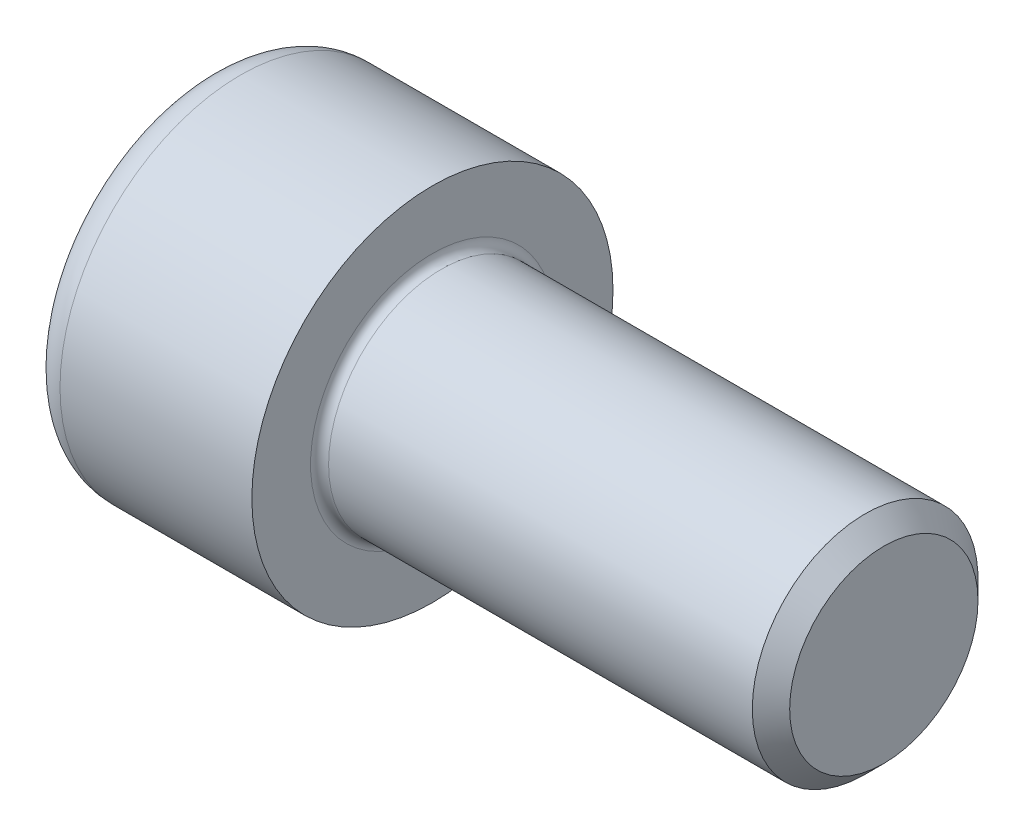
ISO-10303-21;
HEADER;
FILE_DESCRIPTION(('STEP AP214'),'2;1');
FILE_NAME('part.step','',(''),(''),'','','');
FILE_SCHEMA(('AUTOMOTIVE_DESIGN { 1 0 10303 214 1 1 1 1 }'));
ENDSEC;
DATA;
#1=APPLICATION_CONTEXT('core data for automotive mechanical design processes');
#2=APPLICATION_PROTOCOL_DEFINITION('international standard','automotive_design',2000,#1);
#3=PRODUCT_CONTEXT('',#1,'mechanical');
#4=PRODUCT('Part','Part','',(#3));
#5=PRODUCT_RELATED_PRODUCT_CATEGORY('part','',(#4));
#6=PRODUCT_DEFINITION_FORMATION('','',#4);
#7=PRODUCT_DEFINITION_CONTEXT('part definition',#1,'design');
#8=PRODUCT_DEFINITION('design','',#6,#7);
#9=PRODUCT_DEFINITION_SHAPE('','',#8);
#10=(LENGTH_UNIT() NAMED_UNIT(*) SI_UNIT(.MILLI.,.METRE.));
#11=(NAMED_UNIT(*) PLANE_ANGLE_UNIT() SI_UNIT($,.RADIAN.));
#12=(NAMED_UNIT(*) SI_UNIT($,.STERADIAN.) SOLID_ANGLE_UNIT());
#13=UNCERTAINTY_MEASURE_WITH_UNIT(LENGTH_MEASURE(1.E-05),#10,'distance_accuracy_value','');
#14=(GEOMETRIC_REPRESENTATION_CONTEXT(3) GLOBAL_UNCERTAINTY_ASSIGNED_CONTEXT((#13)) GLOBAL_UNIT_ASSIGNED_CONTEXT((#10,
#11,#12)) REPRESENTATION_CONTEXT('',''));
#15=CARTESIAN_POINT('',(0.,0.,0.));
#16=DIRECTION('',(0.,0.,1.));
#17=DIRECTION('',(1.,0.,0.));
#18=AXIS2_PLACEMENT_3D('',#15,#16,#17);
#19=CARTESIAN_POINT('',(0.,0.,0.));
#20=DIRECTION('',(-1.,0.,0.));
#21=DIRECTION('',(0.,0.,1.));
#22=AXIS2_PLACEMENT_3D('',#19,#20,#21);
#23=PLANE('',#22);
#24=DIRECTION('',(0.,-0.499999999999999,0.866025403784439));
#25=VECTOR('',#24,1.);
#26=CARTESIAN_POINT('',(0.,4.68519743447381,0.));
#27=LINE('',#26,#25);
#28=CARTESIAN_POINT('',(0.,4.68519743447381,0.));
#29=VERTEX_POINT('',#28);
#30=CARTESIAN_POINT('',(0.,2.34259871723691,4.05749999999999));
#31=VERTEX_POINT('',#30);
#32=EDGE_CURVE('E257',#29,#31,#27,.T.);
#33=ORIENTED_EDGE('',*,*,#32,.T.);
#34=DIRECTION('',(0.,1.,0.));
#35=VECTOR('',#34,1.);
#36=CARTESIAN_POINT('',(0.,-2.3425987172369,4.0575));
#37=LINE('',#36,#35);
#38=CARTESIAN_POINT('',(0.,-2.3425987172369,4.0575));
#39=VERTEX_POINT('',#38);
#40=EDGE_CURVE('E129',#39,#31,#37,.T.);
#41=ORIENTED_EDGE('',*,*,#40,.F.);
#42=DIRECTION('',(0.,-0.500000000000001,-0.866025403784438));
#43=VECTOR('',#42,1.);
#44=CARTESIAN_POINT('',(0.,-2.3425987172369,4.0575));
#45=LINE('',#44,#43);
#46=CARTESIAN_POINT('',(0.,-4.68519743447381,0.));
#47=VERTEX_POINT('',#46);
#48=EDGE_CURVE('E260',#39,#47,#45,.T.);
#49=ORIENTED_EDGE('',*,*,#48,.T.);
#50=DIRECTION('',(0.,0.499999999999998,-0.86602540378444));
#51=VECTOR('',#50,1.);
#52=CARTESIAN_POINT('',(0.,-4.68519743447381,0.));
#53=LINE('',#52,#51);
#54=CARTESIAN_POINT('',(0.,-2.34259871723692,-4.0575));
#55=VERTEX_POINT('',#54);
#56=EDGE_CURVE('E263',#47,#55,#53,.T.);
#57=ORIENTED_EDGE('',*,*,#56,.T.);
#58=DIRECTION('',(0.,-1.,0.));
#59=VECTOR('',#58,1.);
#60=CARTESIAN_POINT('',(0.,2.3425987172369,-4.0575));
#61=LINE('',#60,#59);
#62=CARTESIAN_POINT('',(0.,2.3425987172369,-4.0575));
#63=VERTEX_POINT('',#62);
#64=EDGE_CURVE('E266',#63,#55,#61,.T.);
#65=ORIENTED_EDGE('',*,*,#64,.F.);
#66=DIRECTION('',(0.,-0.500000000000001,-0.866025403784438));
#67=VECTOR('',#66,1.);
#68=CARTESIAN_POINT('',(0.,4.68519743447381,0.));
#69=LINE('',#68,#67);
#70=EDGE_CURVE('E124',#29,#63,#69,.T.);
#71=ORIENTED_EDGE('',*,*,#70,.F.);
#72=EDGE_LOOP('',(#33,#41,#49,#57,#65,#71));
#73=FACE_BOUND('',#72,.T.);
#74=CARTESIAN_POINT('',(0.,0.,0.));
#75=DIRECTION('',(-1.,0.,0.));
#76=DIRECTION('',(0.,0.,1.));
#77=AXIS2_PLACEMENT_3D('',#74,#75,#76);
#78=CIRCLE('',#77,6.5);
#79=CARTESIAN_POINT('',(0.,0.,6.5));
#80=VERTEX_POINT('',#79);
#81=EDGE_CURVE('E41',#80,#80,#78,.T.);
#82=ORIENTED_EDGE('',*,*,#81,.T.);
#83=EDGE_LOOP('',(#82));
#84=FACE_BOUND('',#83,.T.);
#85=ADVANCED_FACE('F33',(#73,#84),#23,.T.);
#86=CARTESIAN_POINT('',(-31.75,0.,0.));
#87=DIRECTION('',(-1.,0.,0.));
#88=DIRECTION('',(0.,0.,1.));
#89=AXIS2_PLACEMENT_3D('',#86,#87,#88);
#90=CYLINDRICAL_SURFACE('',#89,8.);
#91=CARTESIAN_POINT('',(1.5,0.,0.));
#92=DIRECTION('',(-1.,0.,0.));
#93=DIRECTION('',(0.,0.,1.));
#94=AXIS2_PLACEMENT_3D('',#91,#92,#93);
#95=CIRCLE('',#94,8.);
#96=CARTESIAN_POINT('',(1.5,0.,8.));
#97=VERTEX_POINT('',#96);
#98=EDGE_CURVE('E11',#97,#97,#95,.F.);
#99=ORIENTED_EDGE('',*,*,#98,.T.);
#100=EDGE_LOOP('',(#99));
#101=FACE_BOUND('',#100,.T.);
#102=CARTESIAN_POINT('',(10.,0.,0.));
#103=DIRECTION('',(-1.,0.,0.));
#104=DIRECTION('',(0.,0.,1.));
#105=AXIS2_PLACEMENT_3D('',#102,#103,#104);
#106=CIRCLE('',#105,8.);
#107=CARTESIAN_POINT('',(10.,0.,8.));
#108=VERTEX_POINT('',#107);
#109=EDGE_CURVE('E147',#108,#108,#106,.T.);
#110=ORIENTED_EDGE('',*,*,#109,.T.);
#111=EDGE_LOOP('',(#110));
#112=FACE_BOUND('',#111,.T.);
#113=ADVANCED_FACE('F171',(#101,#112),#90,.T.);
#114=CARTESIAN_POINT('',(10.,8.,0.));
#115=DIRECTION('',(1.,0.,0.));
#116=DIRECTION('',(0.,0.,-1.));
#117=AXIS2_PLACEMENT_3D('',#114,#115,#116);
#118=PLANE('',#117);
#119=CARTESIAN_POINT('',(10.,0.,0.));
#120=DIRECTION('',(1.,0.,0.));
#121=DIRECTION('',(0.,0.,-1.));
#122=AXIS2_PLACEMENT_3D('',#119,#120,#121);
#123=CIRCLE('',#122,5.4);
#124=CARTESIAN_POINT('',(10.,0.,-5.4));
#125=VERTEX_POINT('',#124);
#126=EDGE_CURVE('E150',#125,#125,#123,.F.);
#127=ORIENTED_EDGE('',*,*,#126,.T.);
#128=EDGE_LOOP('',(#127));
#129=FACE_BOUND('',#128,.T.);
#130=ORIENTED_EDGE('',*,*,#109,.F.);
#131=EDGE_LOOP('',(#130));
#132=FACE_BOUND('',#131,.T.);
#133=ADVANCED_FACE('F177',(#129,#132),#118,.T.);
#134=CARTESIAN_POINT('',(-31.75,0.,0.));
#135=DIRECTION('',(-1.,0.,0.));
#136=DIRECTION('',(0.,0.,1.));
#137=AXIS2_PLACEMENT_3D('',#134,#135,#136);
#138=CYLINDRICAL_SURFACE('',#137,5.);
#139=CARTESIAN_POINT('',(10.4,0.,0.));
#140=DIRECTION('',(1.,0.,0.));
#141=DIRECTION('',(0.,0.,-1.));
#142=AXIS2_PLACEMENT_3D('',#139,#140,#141);
#143=CIRCLE('',#142,5.);
#144=CARTESIAN_POINT('',(10.4,0.,-5.));
#145=VERTEX_POINT('',#144);
#146=EDGE_CURVE('E153',#145,#145,#143,.T.);
#147=ORIENTED_EDGE('',*,*,#146,.T.);
#148=EDGE_LOOP('',(#147));
#149=FACE_BOUND('',#148,.T.);
#150=CARTESIAN_POINT('',(29.172,0.,0.));
#151=DIRECTION('',(-1.,0.,0.));
#152=DIRECTION('',(0.,0.,1.));
#153=AXIS2_PLACEMENT_3D('',#150,#151,#152);
#154=CIRCLE('',#153,5.);
#155=CARTESIAN_POINT('',(29.172,0.,5.));
#156=VERTEX_POINT('',#155);
#157=EDGE_CURVE('E144',#156,#156,#154,.T.);
#158=ORIENTED_EDGE('',*,*,#157,.T.);
#159=EDGE_LOOP('',(#158));
#160=FACE_BOUND('',#159,.T.);
#161=ADVANCED_FACE('F183',(#149,#160),#138,.T.);
#162=CARTESIAN_POINT('',(30.,0.,0.));
#163=DIRECTION('',(-1.,0.,0.));
#164=DIRECTION('',(0.,0.,1.));
#165=AXIS2_PLACEMENT_3D('',#162,#163,#164);
#166=CONICAL_SURFACE('',#165,4.172,0.785398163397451);
#167=ORIENTED_EDGE('',*,*,#157,.F.);
#168=EDGE_LOOP('',(#167));
#169=FACE_BOUND('',#168,.T.);
#170=CARTESIAN_POINT('',(30.,0.,0.));
#171=DIRECTION('',(-1.,0.,0.));
#172=DIRECTION('',(0.,0.,1.));
#173=AXIS2_PLACEMENT_3D('',#170,#171,#172);
#174=CIRCLE('',#173,4.172);
#175=CARTESIAN_POINT('',(30.,0.,4.172));
#176=VERTEX_POINT('',#175);
#177=EDGE_CURVE('E140',#176,#176,#174,.T.);
#178=ORIENTED_EDGE('',*,*,#177,.T.);
#179=EDGE_LOOP('',(#178));
#180=FACE_BOUND('',#179,.T.);
#181=ADVANCED_FACE('F187',(#169,#180),#166,.T.);
#182=CARTESIAN_POINT('',(30.,4.172,0.));
#183=DIRECTION('',(1.,0.,0.));
#184=DIRECTION('',(0.,0.,-1.));
#185=AXIS2_PLACEMENT_3D('',#182,#183,#184);
#186=PLANE('',#185);
#187=ORIENTED_EDGE('',*,*,#177,.F.);
#188=EDGE_LOOP('',(#187));
#189=FACE_BOUND('',#188,.T.);
#190=ADVANCED_FACE('F167',(#189),#186,.T.);
#191=CARTESIAN_POINT('',(10.4,0.,0.));
#192=DIRECTION('',(1.,0.,0.));
#193=DIRECTION('',(0.,0.,-1.));
#194=AXIS2_PLACEMENT_3D('',#191,#192,#193);
#195=TOROIDAL_SURFACE('',#194,5.4,0.4);
#196=ORIENTED_EDGE('',*,*,#146,.F.);
#197=EDGE_LOOP('',(#196));
#198=FACE_BOUND('',#197,.T.);
#199=ORIENTED_EDGE('',*,*,#126,.F.);
#200=EDGE_LOOP('',(#199));
#201=FACE_BOUND('',#200,.T.);
#202=ADVANCED_FACE('F160',(#198,#201),#195,.F.);
#203=CARTESIAN_POINT('',(1.5,0.,0.));
#204=DIRECTION('',(-1.,0.,0.));
#205=DIRECTION('',(0.,0.,1.));
#206=AXIS2_PLACEMENT_3D('',#203,#204,#205);
#207=TOROIDAL_SURFACE('',#206,6.5,1.5);
#208=ORIENTED_EDGE('',*,*,#98,.F.);
#209=EDGE_LOOP('',(#208));
#210=FACE_BOUND('',#209,.T.);
#211=ORIENTED_EDGE('',*,*,#81,.F.);
#212=EDGE_LOOP('',(#211));
#213=FACE_BOUND('',#212,.T.);
#214=ADVANCED_FACE('F35',(#210,#213),#207,.T.);
#215=CARTESIAN_POINT('',(5.,4.68519743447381,0.));
#216=DIRECTION('',(0.,-0.866025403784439,-0.499999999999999));
#217=DIRECTION('',(0.,0.499999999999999,-0.866025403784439));
#218=AXIS2_PLACEMENT_3D('',#215,#216,#217);
#219=PLANE('',#218);
#220=ORIENTED_EDGE('',*,*,#32,.F.);
#221=DIRECTION('',(-1.,0.,0.));
#222=VECTOR('',#221,1.);
#223=CARTESIAN_POINT('',(5.,4.68519743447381,0.));
#224=LINE('',#223,#222);
#225=CARTESIAN_POINT('',(5.,4.68519743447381,0.));
#226=VERTEX_POINT('',#225);
#227=EDGE_CURVE('E247',#226,#29,#224,.T.);
#228=ORIENTED_EDGE('',*,*,#227,.F.);
#229=DIRECTION('',(0.,-0.499999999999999,0.866025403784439));
#230=VECTOR('',#229,1.);
#231=CARTESIAN_POINT('',(5.,4.68519743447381,0.));
#232=LINE('',#231,#230);
#233=CARTESIAN_POINT('',(5.,3.51389807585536,2.02874999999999));
#234=VERTEX_POINT('',#233);
#235=EDGE_CURVE('E116',#226,#234,#232,.T.);
#236=ORIENTED_EDGE('',*,*,#235,.T.);
#237=CARTESIAN_POINT('',(5.,2.34259871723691,4.05749999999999));
#238=VERTEX_POINT('',#237);
#239=EDGE_CURVE('E107',#234,#238,#232,.T.);
#240=ORIENTED_EDGE('',*,*,#239,.T.);
#241=DIRECTION('',(-1.,0.,0.));
#242=VECTOR('',#241,1.);
#243=CARTESIAN_POINT('',(5.,2.34259871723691,4.05749999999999));
#244=LINE('',#243,#242);
#245=EDGE_CURVE('E121',#238,#31,#244,.T.);
#246=ORIENTED_EDGE('',*,*,#245,.T.);
#247=EDGE_LOOP('',(#220,#228,#236,#240,#246));
#248=FACE_BOUND('',#247,.T.);
#249=ADVANCED_FACE('F120',(#248),#219,.T.);
#250=CARTESIAN_POINT('',(5.,-2.3425987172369,4.0575));
#251=DIRECTION('',(0.,0.,1.));
#252=DIRECTION('',(0.,-1.,0.));
#253=AXIS2_PLACEMENT_3D('',#250,#251,#252);
#254=PLANE('',#253);
#255=ORIENTED_EDGE('',*,*,#40,.T.);
#256=ORIENTED_EDGE('',*,*,#245,.F.);
#257=DIRECTION('',(0.,1.,0.));
#258=VECTOR('',#257,1.);
#259=CARTESIAN_POINT('',(5.,-2.3425987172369,4.0575));
#260=LINE('',#259,#258);
#261=CARTESIAN_POINT('',(5.,0.,4.05749999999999));
#262=VERTEX_POINT('',#261);
#263=EDGE_CURVE('E104',#262,#238,#260,.T.);
#264=ORIENTED_EDGE('',*,*,#263,.F.);
#265=CARTESIAN_POINT('',(5.,-2.3425987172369,4.0575));
#266=VERTEX_POINT('',#265);
#267=EDGE_CURVE('E115',#266,#262,#260,.T.);
#268=ORIENTED_EDGE('',*,*,#267,.F.);
#269=DIRECTION('',(-1.,0.,0.));
#270=VECTOR('',#269,1.);
#271=CARTESIAN_POINT('',(5.,-2.3425987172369,4.0575));
#272=LINE('',#271,#270);
#273=EDGE_CURVE('E131',#266,#39,#272,.T.);
#274=ORIENTED_EDGE('',*,*,#273,.T.);
#275=EDGE_LOOP('',(#255,#256,#264,#268,#274));
#276=FACE_BOUND('',#275,.T.);
#277=ADVANCED_FACE('F126',(#276),#254,.F.);
#278=CARTESIAN_POINT('',(5.,-2.3425987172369,4.0575));
#279=DIRECTION('',(0.,0.866025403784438,-0.500000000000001));
#280=DIRECTION('',(0.,0.500000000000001,0.866025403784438));
#281=AXIS2_PLACEMENT_3D('',#278,#279,#280);
#282=PLANE('',#281);
#283=ORIENTED_EDGE('',*,*,#48,.F.);
#284=ORIENTED_EDGE('',*,*,#273,.F.);
#285=DIRECTION('',(0.,-0.500000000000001,-0.866025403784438));
#286=VECTOR('',#285,1.);
#287=CARTESIAN_POINT('',(5.,-2.3425987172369,4.0575));
#288=LINE('',#287,#286);
#289=CARTESIAN_POINT('',(5.,-3.51389807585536,2.02875));
#290=VERTEX_POINT('',#289);
#291=EDGE_CURVE('E286',#266,#290,#288,.T.);
#292=ORIENTED_EDGE('',*,*,#291,.T.);
#293=CARTESIAN_POINT('',(5.,-4.68519743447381,0.));
#294=VERTEX_POINT('',#293);
#295=EDGE_CURVE('E275',#290,#294,#288,.T.);
#296=ORIENTED_EDGE('',*,*,#295,.T.);
#297=DIRECTION('',(-1.,0.,0.));
#298=VECTOR('',#297,1.);
#299=CARTESIAN_POINT('',(5.,-4.68519743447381,0.));
#300=LINE('',#299,#298);
#301=EDGE_CURVE('E136',#294,#47,#300,.T.);
#302=ORIENTED_EDGE('',*,*,#301,.T.);
#303=EDGE_LOOP('',(#283,#284,#292,#296,#302));
#304=FACE_BOUND('',#303,.T.);
#305=ADVANCED_FACE('F201',(#304),#282,.T.);
#306=CARTESIAN_POINT('',(5.,-4.68519743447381,0.));
#307=DIRECTION('',(0.,0.86602540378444,0.499999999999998));
#308=DIRECTION('',(0.,-0.499999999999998,0.86602540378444));
#309=AXIS2_PLACEMENT_3D('',#306,#307,#308);
#310=PLANE('',#309);
#311=ORIENTED_EDGE('',*,*,#56,.F.);
#312=ORIENTED_EDGE('',*,*,#301,.F.);
#313=DIRECTION('',(0.,0.499999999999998,-0.86602540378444));
#314=VECTOR('',#313,1.);
#315=CARTESIAN_POINT('',(5.,-4.68519743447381,0.));
#316=LINE('',#315,#314);
#317=CARTESIAN_POINT('',(5.,-3.51389807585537,-2.02875));
#318=VERTEX_POINT('',#317);
#319=EDGE_CURVE('E253',#294,#318,#316,.T.);
#320=ORIENTED_EDGE('',*,*,#319,.T.);
#321=CARTESIAN_POINT('',(5.,-2.34259871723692,-4.0575));
#322=VERTEX_POINT('',#321);
#323=EDGE_CURVE('E285',#318,#322,#316,.T.);
#324=ORIENTED_EDGE('',*,*,#323,.T.);
#325=DIRECTION('',(-1.,0.,0.));
#326=VECTOR('',#325,1.);
#327=CARTESIAN_POINT('',(5.,-2.34259871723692,-4.0575));
#328=LINE('',#327,#326);
#329=EDGE_CURVE('E246',#322,#55,#328,.T.);
#330=ORIENTED_EDGE('',*,*,#329,.T.);
#331=EDGE_LOOP('',(#311,#312,#320,#324,#330));
#332=FACE_BOUND('',#331,.T.);
#333=ADVANCED_FACE('F204',(#332),#310,.T.);
#334=CARTESIAN_POINT('',(5.,2.3425987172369,-4.0575));
#335=DIRECTION('',(0.,0.,-1.));
#336=DIRECTION('',(0.,1.,0.));
#337=AXIS2_PLACEMENT_3D('',#334,#335,#336);
#338=PLANE('',#337);
#339=ORIENTED_EDGE('',*,*,#64,.T.);
#340=ORIENTED_EDGE('',*,*,#329,.F.);
#341=DIRECTION('',(0.,-1.,0.));
#342=VECTOR('',#341,1.);
#343=CARTESIAN_POINT('',(5.,2.3425987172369,-4.0575));
#344=LINE('',#343,#342);
#345=CARTESIAN_POINT('',(5.,0.,-4.0575));
#346=VERTEX_POINT('',#345);
#347=EDGE_CURVE('E250',#346,#322,#344,.T.);
#348=ORIENTED_EDGE('',*,*,#347,.F.);
#349=CARTESIAN_POINT('',(5.,2.3425987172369,-4.0575));
#350=VERTEX_POINT('',#349);
#351=EDGE_CURVE('E48',#350,#346,#344,.T.);
#352=ORIENTED_EDGE('',*,*,#351,.F.);
#353=DIRECTION('',(-1.,0.,0.));
#354=VECTOR('',#353,1.);
#355=CARTESIAN_POINT('',(5.,2.3425987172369,-4.0575));
#356=LINE('',#355,#354);
#357=EDGE_CURVE('E243',#350,#63,#356,.T.);
#358=ORIENTED_EDGE('',*,*,#357,.T.);
#359=EDGE_LOOP('',(#339,#340,#348,#352,#358));
#360=FACE_BOUND('',#359,.T.);
#361=ADVANCED_FACE('F208',(#360),#338,.F.);
#362=CARTESIAN_POINT('',(5.,4.68519743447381,0.));
#363=DIRECTION('',(0.,0.866025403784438,-0.500000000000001));
#364=DIRECTION('',(0.,0.500000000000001,0.866025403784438));
#365=AXIS2_PLACEMENT_3D('',#362,#363,#364);
#366=PLANE('',#365);
#367=ORIENTED_EDGE('',*,*,#70,.T.);
#368=ORIENTED_EDGE('',*,*,#357,.F.);
#369=DIRECTION('',(0.,-0.500000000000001,-0.866025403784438));
#370=VECTOR('',#369,1.);
#371=CARTESIAN_POINT('',(5.,4.68519743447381,0.));
#372=LINE('',#371,#370);
#373=CARTESIAN_POINT('',(5.,3.51389807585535,-2.02875));
#374=VERTEX_POINT('',#373);
#375=EDGE_CURVE('E233',#374,#350,#372,.T.);
#376=ORIENTED_EDGE('',*,*,#375,.F.);
#377=EDGE_CURVE('E239',#226,#374,#372,.T.);
#378=ORIENTED_EDGE('',*,*,#377,.F.);
#379=ORIENTED_EDGE('',*,*,#227,.T.);
#380=EDGE_LOOP('',(#367,#368,#376,#378,#379));
#381=FACE_BOUND('',#380,.T.);
#382=ADVANCED_FACE('F212',(#381),#366,.F.);
#383=CARTESIAN_POINT('',(5.,7.02779615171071,-4.05750000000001));
#384=DIRECTION('',(1.,0.,0.));
#385=DIRECTION('',(0.,0.,-1.));
#386=AXIS2_PLACEMENT_3D('',#383,#384,#385);
#387=PLANE('',#386);
#388=ORIENTED_EDGE('',*,*,#347,.T.);
#389=ORIENTED_EDGE('',*,*,#323,.F.);
#390=CARTESIAN_POINT('',(5.,0.,0.));
#391=DIRECTION('',(-1.,0.,0.));
#392=DIRECTION('',(0.,0.,1.));
#393=AXIS2_PLACEMENT_3D('',#390,#391,#392);
#394=CIRCLE('',#393,4.0575);
#395=EDGE_CURVE('E281',#346,#318,#394,.T.);
#396=ORIENTED_EDGE('',*,*,#395,.F.);
#397=EDGE_LOOP('',(#388,#389,#396));
#398=FACE_BOUND('',#397,.T.);
#399=ADVANCED_FACE('F216',(#398),#387,.F.);
#400=ORIENTED_EDGE('',*,*,#319,.F.);
#401=ORIENTED_EDGE('',*,*,#295,.F.);
#402=EDGE_CURVE('E134',#318,#290,#394,.T.);
#403=ORIENTED_EDGE('',*,*,#402,.F.);
#404=EDGE_LOOP('',(#400,#401,#403));
#405=FACE_BOUND('',#404,.T.);
#406=ADVANCED_FACE('F219',(#405),#387,.F.);
#407=ORIENTED_EDGE('',*,*,#291,.F.);
#408=ORIENTED_EDGE('',*,*,#267,.T.);
#409=EDGE_CURVE('E130',#290,#262,#394,.T.);
#410=ORIENTED_EDGE('',*,*,#409,.F.);
#411=EDGE_LOOP('',(#407,#408,#410));
#412=FACE_BOUND('',#411,.T.);
#413=ADVANCED_FACE('F224',(#412),#387,.F.);
#414=ORIENTED_EDGE('',*,*,#263,.T.);
#415=ORIENTED_EDGE('',*,*,#239,.F.);
#416=EDGE_CURVE('E110',#262,#234,#394,.T.);
#417=ORIENTED_EDGE('',*,*,#416,.F.);
#418=EDGE_LOOP('',(#414,#415,#417));
#419=FACE_BOUND('',#418,.T.);
#420=ADVANCED_FACE('F106',(#419),#387,.F.);
#421=ORIENTED_EDGE('',*,*,#235,.F.);
#422=ORIENTED_EDGE('',*,*,#377,.T.);
#423=EDGE_CURVE('E141',#234,#374,#394,.T.);
#424=ORIENTED_EDGE('',*,*,#423,.F.);
#425=EDGE_LOOP('',(#421,#422,#424));
#426=FACE_BOUND('',#425,.T.);
#427=ADVANCED_FACE('F227',(#426),#387,.F.);
#428=ORIENTED_EDGE('',*,*,#375,.T.);
#429=ORIENTED_EDGE('',*,*,#351,.T.);
#430=EDGE_CURVE('E236',#374,#346,#394,.T.);
#431=ORIENTED_EDGE('',*,*,#430,.F.);
#432=EDGE_LOOP('',(#428,#429,#431));
#433=FACE_BOUND('',#432,.T.);
#434=ADVANCED_FACE('F197',(#433),#387,.F.);
#435=CARTESIAN_POINT('',(5.,0.,0.));
#436=DIRECTION('',(-1.,0.,0.));
#437=DIRECTION('',(0.,0.,1.));
#438=AXIS2_PLACEMENT_3D('',#435,#436,#437);
#439=CONICAL_SURFACE('',#438,4.0575,1.04719755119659);
#440=CARTESIAN_POINT('',(7.34259871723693,0.,0.));
#441=VERTEX_POINT('',#440);
#442=VERTEX_LOOP('',#441);
#443=FACE_BOUND('',#442,.T.);
#444=ORIENTED_EDGE('',*,*,#416,.T.);
#445=ORIENTED_EDGE('',*,*,#423,.T.);
#446=ORIENTED_EDGE('',*,*,#430,.T.);
#447=ORIENTED_EDGE('',*,*,#395,.T.);
#448=ORIENTED_EDGE('',*,*,#402,.T.);
#449=ORIENTED_EDGE('',*,*,#409,.T.);
#450=EDGE_LOOP('',(#444,#445,#446,#447,#448,#449));
#451=FACE_BOUND('',#450,.T.);
#452=ADVANCED_FACE('F195',(#443,#451),#439,.F.);
#453=CLOSED_SHELL('',(#85,#113,#133,#161,#181,#190,#202,#214,#249,#277,#305,#333,#361,#382,#399,
#406,#413,#420,#427,#434,#452));
#454=MANIFOLD_SOLID_BREP('B2',#453);
#455=ADVANCED_BREP_SHAPE_REPRESENTATION('',(#18,#454),#14);
#456=SHAPE_DEFINITION_REPRESENTATION(#9,#455);
ENDSEC;
END-ISO-10303-21;
